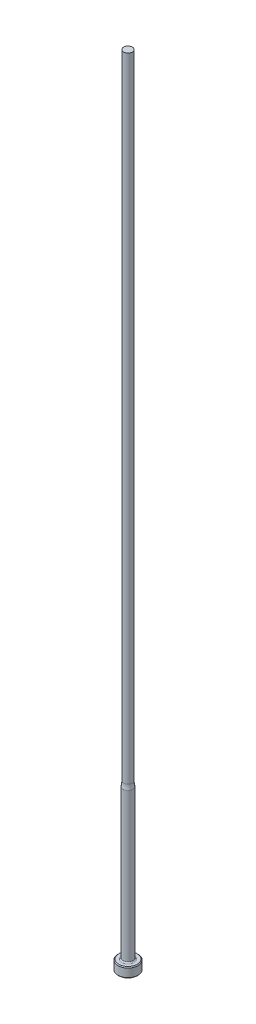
from build123d import *

# Parameters (mm, degrees)
CHAMFER1_SIZE = 0.254
FILLET1_R     = 0.381


with BuildPart() as part:
    # Sketch1 → Revolve1 (revolve)
    with BuildSketch(Plane.XY, mode=Mode.PRIVATE) as revolve1_sk:
        with BuildLine():
            Line((0, 0), (-3.175, 0))
            Line((-3.175, 0), (-3.175, 3.175))
            Line((-3.175, 3.175), (-1.5875, 3.175))
            Line((-1.5875, 3.175), (-1.5875, 50.8))
            ThreePointArc((-1.5875, 50.8), (-1.438154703, 51.583111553), (-1.38811, 52.378764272))
            Line((-1.38811, 52.378764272), (-1.38811, 254))
            Line((-1.38811, 254), (0, 254))
            Line((0, 254), (0, 0))
        make_face()
    revolve(revolve1_sk.sketch.rotate(Axis((0, 259.958771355, 0), (0, -1, 0)), 270), axis=Axis((0, 259.958771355, 0), (0, -1, 0)))

    # Chamfer1
    chamfer1_edges = [part.edges().sort_by_distance(p)[0] for p in [
        (0, 0, -3.175),
        (0, 3.175, -3.175),
    ]]
    chamfer(chamfer1_edges, length=CHAMFER1_SIZE)

    # Fillet1
    fillet1_edges = [part.edges().sort_by_distance(p)[0] for p in [
        (0, 3.175, -1.5875),
    ]]
    fillet(fillet1_edges, radius=FILLET1_R)


solid = part.part
